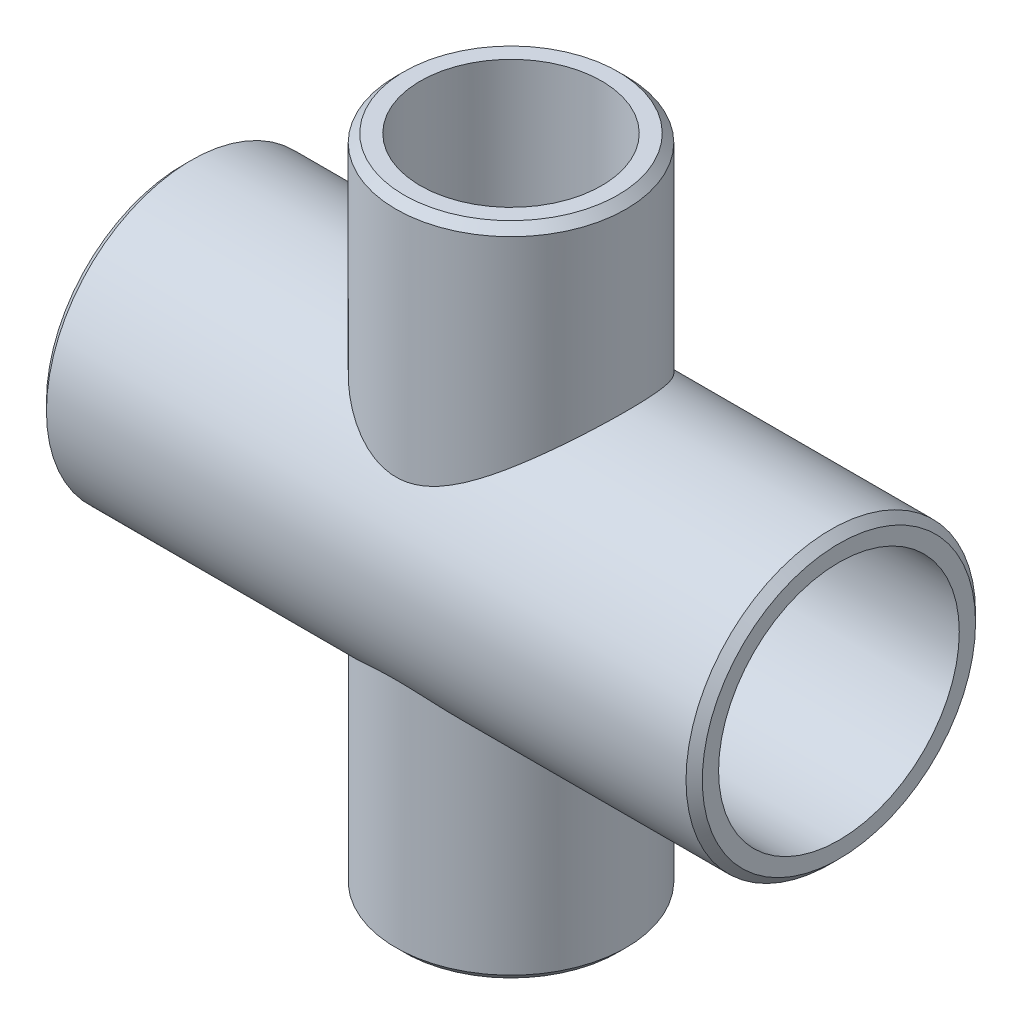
from build123d import *

# Parameters (mm, degrees)
RUNROUTE_R          = 21.082
RUNEXTRUDE_DEPTH    = 47.752
OUTLETROUTE_R       = 16.764
OUTLETEXTRUDE_DEPTH = 47.752
CROSSSHELL_T        = -3.556
CROSSCHAMFER_SIZE   = 1.185333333


with BuildPart() as part:
    # RunRoute → RunExtrude (new body)
    with BuildSketch(Plane(origin=(0, 0, 0), x_dir=(0, 0, -1), z_dir=(1, 0, 0))):
        Circle(RUNROUTE_R)
    runextrude = extrude(amount=RUNEXTRUDE_DEPTH)

    # RunExtrudeMirror: RunExtrude across plane
    add(runextrude.mirror(Plane(origin=(0, 0, 0), x_dir=(0, 0, 1), z_dir=(1, 0, 0))))

    # OutletRoute → OutletExtrude (add)
    with BuildSketch(Plane(origin=(0, 0, 0), x_dir=(1, 0, 0), z_dir=(0, 1, 0))):
        with Locations(Location((0, 0, 0), (0, 0, 90))):
            Circle(OUTLETROUTE_R)
    outletextrude = extrude(amount=OUTLETEXTRUDE_DEPTH)

    # OutletExtrudeMirror: OutletExtrude across plane
    add(outletextrude.mirror(Plane.ZX))

    # CrossShell
    crossshell_openings = [part.faces().sort_by_distance(p)[0] for p in [
        (47.752, 0, 0),
        (0, -47.752, 0),
        (-47.752, 0, 0),
        (0, 47.752, 0),
    ]]
    offset(amount=CROSSSHELL_T, openings=crossshell_openings, kind=Kind.INTERSECTION)

    # CrossChamfer
    crosschamfer_edges = [part.edges().sort_by_distance(p)[0] for p in [
        (0, -47.752, 16.764),
        (47.752, 0, 21.082),
        (-47.752, 0, 21.082),
        (0, 47.752, 16.764),
    ]]
    chamfer(crosschamfer_edges, length=CROSSCHAMFER_SIZE)


solid = part.part
